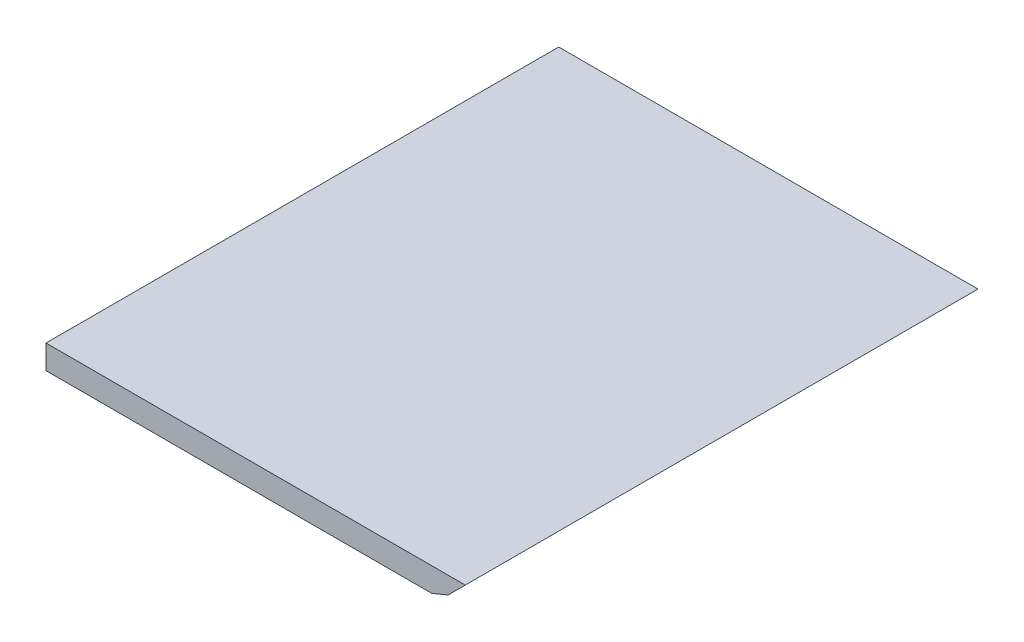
ISO-10303-21;
HEADER;
FILE_DESCRIPTION(('STEP AP214'),'2;1');
FILE_NAME('part.step','',(''),(''),'','','');
FILE_SCHEMA(('AUTOMOTIVE_DESIGN { 1 0 10303 214 1 1 1 1 }'));
ENDSEC;
DATA;
#1=APPLICATION_CONTEXT('core data for automotive mechanical design processes');
#2=APPLICATION_PROTOCOL_DEFINITION('international standard','automotive_design',2000,#1);
#3=PRODUCT_CONTEXT('',#1,'mechanical');
#4=PRODUCT('Part','Part','',(#3));
#5=PRODUCT_RELATED_PRODUCT_CATEGORY('part','',(#4));
#6=PRODUCT_DEFINITION_FORMATION('','',#4);
#7=PRODUCT_DEFINITION_CONTEXT('part definition',#1,'design');
#8=PRODUCT_DEFINITION('design','',#6,#7);
#9=PRODUCT_DEFINITION_SHAPE('','',#8);
#10=(LENGTH_UNIT() NAMED_UNIT(*) SI_UNIT(.MILLI.,.METRE.));
#11=(NAMED_UNIT(*) PLANE_ANGLE_UNIT() SI_UNIT($,.RADIAN.));
#12=(NAMED_UNIT(*) SI_UNIT($,.STERADIAN.) SOLID_ANGLE_UNIT());
#13=UNCERTAINTY_MEASURE_WITH_UNIT(LENGTH_MEASURE(1.E-05),#10,'distance_accuracy_value','');
#14=(GEOMETRIC_REPRESENTATION_CONTEXT(3) GLOBAL_UNCERTAINTY_ASSIGNED_CONTEXT((#13)) GLOBAL_UNIT_ASSIGNED_CONTEXT((#10,
#11,#12)) REPRESENTATION_CONTEXT('',''));
#15=CARTESIAN_POINT('',(0.,0.,0.));
#16=DIRECTION('',(0.,0.,1.));
#17=DIRECTION('',(1.,0.,0.));
#18=AXIS2_PLACEMENT_3D('',#15,#16,#17);
#19=CARTESIAN_POINT('',(165.,10.,0.));
#20=DIRECTION('',(0.,1.,0.));
#21=DIRECTION('',(1.,0.,0.));
#22=AXIS2_PLACEMENT_3D('',#19,#20,#21);
#23=PLANE('',#22);
#24=DIRECTION('',(0.,0.,-1.));
#25=VECTOR('',#24,1.);
#26=CARTESIAN_POINT('',(-185.,10.,0.));
#27=LINE('',#26,#25);
#28=CARTESIAN_POINT('',(-185.,10.,0.));
#29=VERTEX_POINT('',#28);
#30=CARTESIAN_POINT('',(-185.,10.,-428.));
#31=VERTEX_POINT('',#30);
#32=EDGE_CURVE('E86',#29,#31,#27,.T.);
#33=ORIENTED_EDGE('',*,*,#32,.F.);
#34=DIRECTION('',(-1.,0.,0.));
#35=VECTOR('',#34,1.);
#36=CARTESIAN_POINT('',(165.,10.,0.));
#37=LINE('',#36,#35);
#38=CARTESIAN_POINT('',(165.,10.,0.));
#39=VERTEX_POINT('',#38);
#40=EDGE_CURVE('E114',#39,#29,#37,.T.);
#41=ORIENTED_EDGE('',*,*,#40,.F.);
#42=DIRECTION('',(0.,0.,-1.));
#43=VECTOR('',#42,1.);
#44=CARTESIAN_POINT('',(165.,10.,0.));
#45=LINE('',#44,#43);
#46=CARTESIAN_POINT('',(165.,10.,-428.));
#47=VERTEX_POINT('',#46);
#48=EDGE_CURVE('E9',#39,#47,#45,.T.);
#49=ORIENTED_EDGE('',*,*,#48,.T.);
#50=DIRECTION('',(-1.,0.,0.));
#51=VECTOR('',#50,1.);
#52=CARTESIAN_POINT('',(165.,10.,-428.));
#53=LINE('',#52,#51);
#54=EDGE_CURVE('E102',#47,#31,#53,.T.);
#55=ORIENTED_EDGE('',*,*,#54,.T.);
#56=EDGE_LOOP('',(#33,#41,#49,#55));
#57=FACE_BOUND('',#56,.T.);
#58=ADVANCED_FACE('F15',(#57),#23,.T.);
#59=CARTESIAN_POINT('',(-165.,-10.,0.));
#60=DIRECTION('',(0.,-1.,0.));
#61=DIRECTION('',(0.,0.,-1.));
#62=AXIS2_PLACEMENT_3D('',#59,#60,#61);
#63=PLANE('',#62);
#64=DIRECTION('',(0.,0.,-1.));
#65=VECTOR('',#64,1.);
#66=CARTESIAN_POINT('',(137.,-10.,0.));
#67=LINE('',#66,#65);
#68=CARTESIAN_POINT('',(137.,-10.,0.));
#69=VERTEX_POINT('',#68);
#70=CARTESIAN_POINT('',(137.,-10.,-428.));
#71=VERTEX_POINT('',#70);
#72=EDGE_CURVE('E91',#69,#71,#67,.T.);
#73=ORIENTED_EDGE('',*,*,#72,.F.);
#74=DIRECTION('',(1.,0.,0.));
#75=VECTOR('',#74,1.);
#76=CARTESIAN_POINT('',(-185.,-10.,0.));
#77=LINE('',#76,#75);
#78=CARTESIAN_POINT('',(-185.,-10.,0.));
#79=VERTEX_POINT('',#78);
#80=EDGE_CURVE('E24',#79,#69,#77,.T.);
#81=ORIENTED_EDGE('',*,*,#80,.F.);
#82=DIRECTION('',(0.,0.,-1.));
#83=VECTOR('',#82,1.);
#84=CARTESIAN_POINT('',(-185.,-10.,0.));
#85=LINE('',#84,#83);
#86=CARTESIAN_POINT('',(-185.,-10.,-428.));
#87=VERTEX_POINT('',#86);
#88=EDGE_CURVE('E122',#79,#87,#85,.T.);
#89=ORIENTED_EDGE('',*,*,#88,.T.);
#90=DIRECTION('',(1.,0.,0.));
#91=VECTOR('',#90,1.);
#92=CARTESIAN_POINT('',(-185.,-10.,-428.));
#93=LINE('',#92,#91);
#94=EDGE_CURVE('E96',#87,#71,#93,.T.);
#95=ORIENTED_EDGE('',*,*,#94,.T.);
#96=EDGE_LOOP('',(#73,#81,#89,#95));
#97=FACE_BOUND('',#96,.T.);
#98=ADVANCED_FACE('F17',(#97),#63,.T.);
#99=CARTESIAN_POINT('',(155.,0.,0.));
#100=DIRECTION('',(0.707106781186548,-0.707106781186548,0.));
#101=DIRECTION('',(0.,0.,-1.));
#102=AXIS2_PLACEMENT_3D('',#99,#100,#101);
#103=PLANE('',#102);
#104=DIRECTION('',(0.,0.,-1.));
#105=VECTOR('',#104,1.);
#106=CARTESIAN_POINT('',(150.656854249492,-4.34314575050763,0.));
#107=LINE('',#106,#105);
#108=CARTESIAN_POINT('',(150.656854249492,-4.34314575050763,0.));
#109=VERTEX_POINT('',#108);
#110=CARTESIAN_POINT('',(150.656854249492,-4.34314575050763,-428.));
#111=VERTEX_POINT('',#110);
#112=EDGE_CURVE('E75',#109,#111,#107,.T.);
#113=ORIENTED_EDGE('',*,*,#112,.T.);
#114=DIRECTION('',(0.707106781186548,0.707106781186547,0.));
#115=VECTOR('',#114,1.);
#116=CARTESIAN_POINT('',(150.656854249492,-4.34314575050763,-428.));
#117=LINE('',#116,#115);
#118=EDGE_CURVE('E79',#111,#47,#117,.T.);
#119=ORIENTED_EDGE('',*,*,#118,.T.);
#120=ORIENTED_EDGE('',*,*,#48,.F.);
#121=DIRECTION('',(-0.707106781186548,-0.707106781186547,0.));
#122=VECTOR('',#121,1.);
#123=CARTESIAN_POINT('',(165.,10.,0.));
#124=LINE('',#123,#122);
#125=EDGE_CURVE('E81',#39,#109,#124,.T.);
#126=ORIENTED_EDGE('',*,*,#125,.T.);
#127=EDGE_LOOP('',(#113,#119,#120,#126));
#128=FACE_BOUND('',#127,.T.);
#129=ADVANCED_FACE('F77',(#128),#103,.T.);
#130=CARTESIAN_POINT('',(0.,0.,0.));
#131=DIRECTION('',(0.,0.,1.));
#132=DIRECTION('',(1.,0.,0.));
#133=AXIS2_PLACEMENT_3D('',#130,#131,#132);
#134=PLANE('',#133);
#135=DIRECTION('',(-0.923879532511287,-0.382683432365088,0.));
#136=VECTOR('',#135,1.);
#137=CARTESIAN_POINT('',(150.656854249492,-4.34314575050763,0.));
#138=LINE('',#137,#136);
#139=EDGE_CURVE('E85',#109,#69,#138,.T.);
#140=ORIENTED_EDGE('',*,*,#139,.F.);
#141=ORIENTED_EDGE('',*,*,#125,.F.);
#142=ORIENTED_EDGE('',*,*,#40,.T.);
#143=DIRECTION('',(0.,-1.,0.));
#144=VECTOR('',#143,1.);
#145=CARTESIAN_POINT('',(-185.,10.,0.));
#146=LINE('',#145,#144);
#147=EDGE_CURVE('E123',#29,#79,#146,.T.);
#148=ORIENTED_EDGE('',*,*,#147,.T.);
#149=ORIENTED_EDGE('',*,*,#80,.T.);
#150=EDGE_LOOP('',(#140,#141,#142,#148,#149));
#151=FACE_BOUND('',#150,.T.);
#152=ADVANCED_FACE('F199',(#151),#134,.T.);
#153=CARTESIAN_POINT('',(143.828427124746,-7.17157287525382,0.));
#154=DIRECTION('',(0.382683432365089,-0.923879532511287,0.));
#155=DIRECTION('',(0.,0.,-1.));
#156=AXIS2_PLACEMENT_3D('',#153,#154,#155);
#157=PLANE('',#156);
#158=ORIENTED_EDGE('',*,*,#112,.F.);
#159=ORIENTED_EDGE('',*,*,#139,.T.);
#160=ORIENTED_EDGE('',*,*,#72,.T.);
#161=DIRECTION('',(0.923879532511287,0.382683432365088,0.));
#162=VECTOR('',#161,1.);
#163=CARTESIAN_POINT('',(137.,-10.,-428.));
#164=LINE('',#163,#162);
#165=EDGE_CURVE('E89',#71,#111,#164,.T.);
#166=ORIENTED_EDGE('',*,*,#165,.T.);
#167=EDGE_LOOP('',(#158,#159,#160,#166));
#168=FACE_BOUND('',#167,.T.);
#169=ADVANCED_FACE('F90',(#168),#157,.T.);
#170=CARTESIAN_POINT('',(-185.,10.,0.));
#171=DIRECTION('',(-1.,0.,0.));
#172=DIRECTION('',(0.,0.,1.));
#173=AXIS2_PLACEMENT_3D('',#170,#171,#172);
#174=PLANE('',#173);
#175=ORIENTED_EDGE('',*,*,#88,.F.);
#176=ORIENTED_EDGE('',*,*,#147,.F.);
#177=ORIENTED_EDGE('',*,*,#32,.T.);
#178=DIRECTION('',(0.,-1.,0.));
#179=VECTOR('',#178,1.);
#180=CARTESIAN_POINT('',(-185.,10.,-428.));
#181=LINE('',#180,#179);
#182=EDGE_CURVE('E113',#31,#87,#181,.T.);
#183=ORIENTED_EDGE('',*,*,#182,.T.);
#184=EDGE_LOOP('',(#175,#176,#177,#183));
#185=FACE_BOUND('',#184,.T.);
#186=ADVANCED_FACE('F217',(#185),#174,.T.);
#187=CARTESIAN_POINT('',(-13.2044114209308,0.318212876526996,-428.));
#188=DIRECTION('',(0.,0.,1.));
#189=DIRECTION('',(1.,0.,0.));
#190=AXIS2_PLACEMENT_3D('',#187,#188,#189);
#191=PLANE('',#190);
#192=ORIENTED_EDGE('',*,*,#118,.F.);
#193=ORIENTED_EDGE('',*,*,#165,.F.);
#194=ORIENTED_EDGE('',*,*,#94,.F.);
#195=ORIENTED_EDGE('',*,*,#182,.F.);
#196=ORIENTED_EDGE('',*,*,#54,.F.);
#197=EDGE_LOOP('',(#192,#193,#194,#195,#196));
#198=FACE_BOUND('',#197,.T.);
#199=ADVANCED_FACE('F99',(#198),#191,.F.);
#200=CLOSED_SHELL('',(#58,#98,#129,#152,#169,#186,#199));
#201=MANIFOLD_SOLID_BREP('B1',#200);
#202=ADVANCED_BREP_SHAPE_REPRESENTATION('',(#18,#201),#14);
#203=SHAPE_DEFINITION_REPRESENTATION(#9,#202);
ENDSEC;
END-ISO-10303-21;
